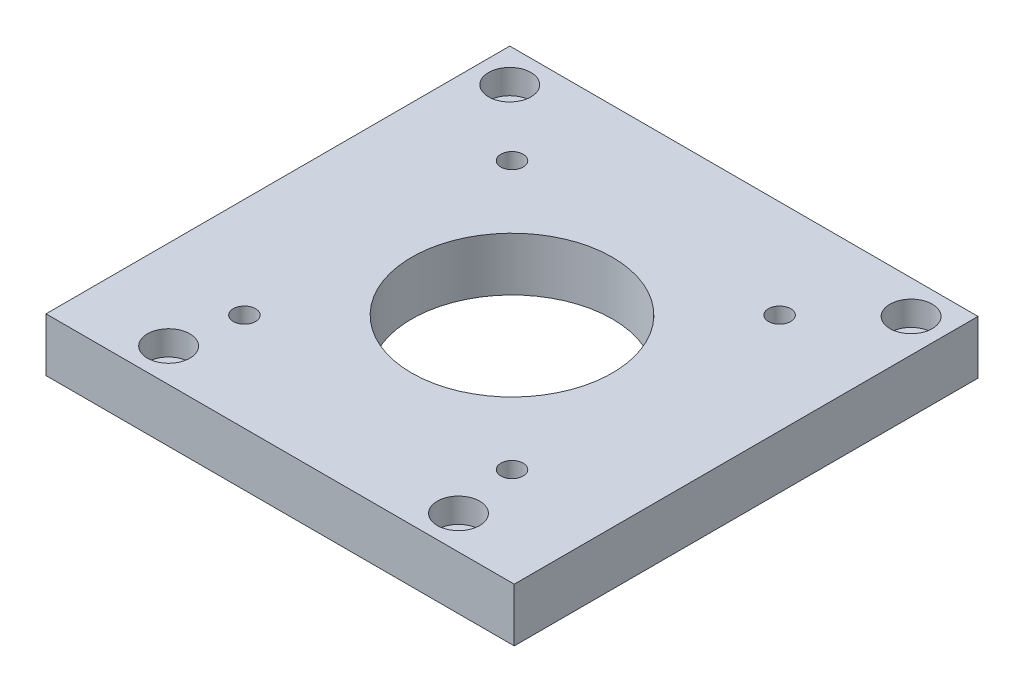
from build123d import *

# Parameters (mm, degrees)
SKETCH_1_W          = 105
SKETCH_1_H          = 12
EXTRUDE_1_DEPTH     = 104
SKETCH_2_R          = 2.75
SKETCH_2_R_2        = 22.5
SKETCH_2_R_3        = 2.5
CUT_EXTRUDE_1_DEPTH = 104
SKETCH_3_R          = 4.75
CUT_EXTRUDE_2_DEPTH = 5.5


with BuildPart() as part:
    # Sketch 1 → Extrude 1 (new body)
    with BuildSketch(Plane.XY):
        with Locations((52.5, 6)):
            Rectangle(SKETCH_1_W, SKETCH_1_H)
    extrude(amount=EXTRUDE_1_DEPTH)

    # Sketch 2 → Cut-Extrude 1 (cut)
    with BuildSketch(Plane(origin=(0, 12, 0), x_dir=(1, 0, 0), z_dir=(0, 1, 0))):
        with Locations(Location((7.5, -7.5, 0), (0, 0, 270))):
            Circle(SKETCH_2_R)
        with Locations(Location((97.5, -7.5, 0), (0, 0, 270))):
            Circle(SKETCH_2_R)
        with Locations(Location((85, -96.5, 0), (0, 0, 270))):
            Circle(SKETCH_2_R)
        with Locations(Location((20, -96.5, 0), (0, 0, 270))):
            Circle(SKETCH_2_R)
        with Locations(Location((52.5, -52, 0), (0, 0, 270))):
            Circle(SKETCH_2_R_2)
        with Locations(Location((22.5, -22, 0), (0, 0, 270))):
            Circle(SKETCH_2_R_3)
        with Locations(Location((82.5, -22, 0), (0, 0, 270))):
            Circle(SKETCH_2_R_3)
        with Locations(Location((82.5, -82, 0), (0, 0, 270))):
            Circle(SKETCH_2_R_3)
        with Locations(Location((22.5, -82, 0), (0, 0, 270))):
            Circle(SKETCH_2_R_3)
    extrude(amount=-CUT_EXTRUDE_1_DEPTH, mode=Mode.SUBTRACT)

    # Sketch 3 → Cut-Extrude 2 (cut)
    with BuildSketch(Plane(origin=(0, 12, 0), x_dir=(1, 0, 0), z_dir=(0, 1, 0))):
        with Locations(Location((7.5, -7.5, 0), (0, 0, 270))):
            Circle(SKETCH_3_R)
        with Locations(Location((97.5, -7.5, 0), (0, 0, 270))):
            Circle(SKETCH_3_R)
        with Locations(Location((85, -96.5, 0), (0, 0, 270))):
            Circle(SKETCH_3_R)
        with Locations(Location((20, -96.5, 0), (0, 0, 270))):
            Circle(SKETCH_3_R)
    extrude(amount=-CUT_EXTRUDE_2_DEPTH, mode=Mode.SUBTRACT)


solid = part.part
